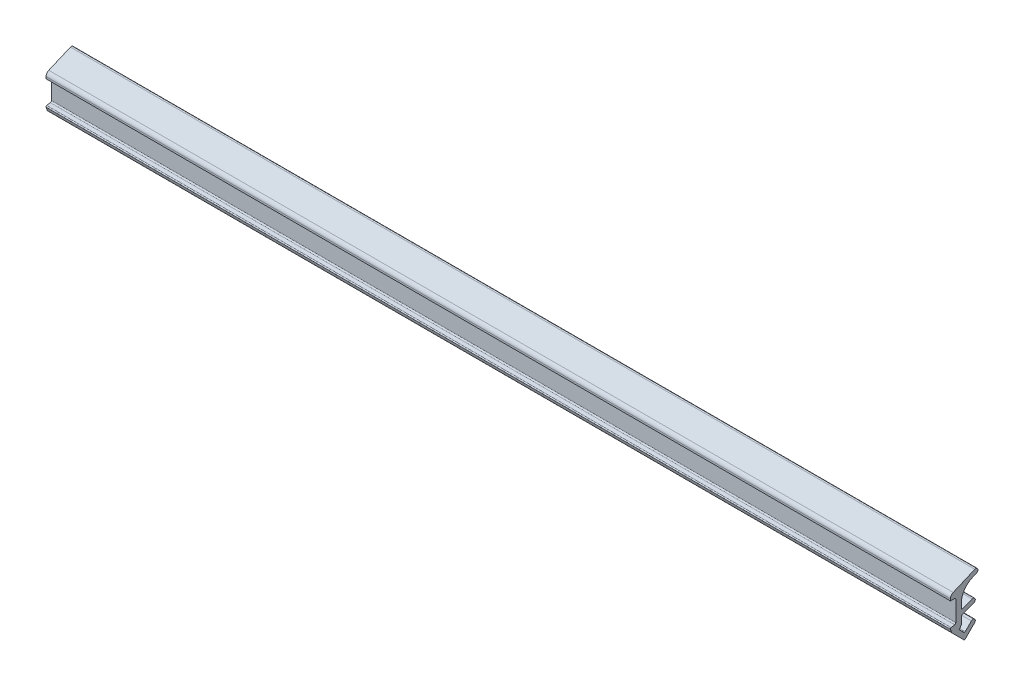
ISO-10303-21;
HEADER;
FILE_DESCRIPTION(('STEP AP214'),'2;1');
FILE_NAME('part.step','',(''),(''),'','','');
FILE_SCHEMA(('AUTOMOTIVE_DESIGN { 1 0 10303 214 1 1 1 1 }'));
ENDSEC;
DATA;
#1=APPLICATION_CONTEXT('core data for automotive mechanical design processes');
#2=APPLICATION_PROTOCOL_DEFINITION('international standard','automotive_design',2000,#1);
#3=PRODUCT_CONTEXT('',#1,'mechanical');
#4=PRODUCT('Part','Part','',(#3));
#5=PRODUCT_RELATED_PRODUCT_CATEGORY('part','',(#4));
#6=PRODUCT_DEFINITION_FORMATION('','',#4);
#7=PRODUCT_DEFINITION_CONTEXT('part definition',#1,'design');
#8=PRODUCT_DEFINITION('design','',#6,#7);
#9=PRODUCT_DEFINITION_SHAPE('','',#8);
#10=(LENGTH_UNIT() NAMED_UNIT(*) SI_UNIT(.MILLI.,.METRE.));
#11=(NAMED_UNIT(*) PLANE_ANGLE_UNIT() SI_UNIT($,.RADIAN.));
#12=(NAMED_UNIT(*) SI_UNIT($,.STERADIAN.) SOLID_ANGLE_UNIT());
#13=UNCERTAINTY_MEASURE_WITH_UNIT(LENGTH_MEASURE(1.E-05),#10,'distance_accuracy_value','');
#14=(GEOMETRIC_REPRESENTATION_CONTEXT(3) GLOBAL_UNCERTAINTY_ASSIGNED_CONTEXT((#13)) GLOBAL_UNIT_ASSIGNED_CONTEXT((#10,
#11,#12)) REPRESENTATION_CONTEXT('',''));
#15=CARTESIAN_POINT('',(0.,0.,0.));
#16=DIRECTION('',(0.,0.,1.));
#17=DIRECTION('',(1.,0.,0.));
#18=AXIS2_PLACEMENT_3D('',#15,#16,#17);
#19=CARTESIAN_POINT('',(200.,1.97501045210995,-4.37734930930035));
#20=DIRECTION('',(-1.,0.,0.));
#21=DIRECTION('',(0.,0.,1.));
#22=AXIS2_PLACEMENT_3D('',#19,#20,#21);
#23=CYLINDRICAL_SURFACE('',#22,4.00000000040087);
#24=CARTESIAN_POINT('',(0.,1.97501045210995,-4.37734930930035));
#25=DIRECTION('',(-1.,0.,0.));
#26=DIRECTION('',(0.,0.,-1.));
#27=AXIS2_PLACEMENT_3D('',#24,#25,#26);
#28=CIRCLE('',#27,4.00000000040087);
#29=CARTESIAN_POINT('',(0.,1.97501045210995,-0.377349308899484));
#30=VERTEX_POINT('',#29);
#31=CARTESIAN_POINT('',(0.,5.65620287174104,-2.81247794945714));
#32=VERTEX_POINT('',#31);
#33=EDGE_CURVE('E375',#30,#32,#28,.T.);
#34=ORIENTED_EDGE('',*,*,#33,.T.);
#35=DIRECTION('',(-1.,0.,0.));
#36=VECTOR('',#35,1.);
#37=CARTESIAN_POINT('',(200.,5.65620287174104,-2.81247794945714));
#38=LINE('',#37,#36);
#39=CARTESIAN_POINT('',(200.,5.65620287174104,-2.81247794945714));
#40=VERTEX_POINT('',#39);
#41=EDGE_CURVE('E13',#40,#32,#38,.T.);
#42=ORIENTED_EDGE('',*,*,#41,.F.);
#43=CARTESIAN_POINT('',(200.,1.97501045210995,-4.37734930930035));
#44=DIRECTION('',(-1.,0.,0.));
#45=DIRECTION('',(0.,0.,-1.));
#46=AXIS2_PLACEMENT_3D('',#43,#44,#45);
#47=CIRCLE('',#46,4.00000000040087);
#48=CARTESIAN_POINT('',(200.,1.97501045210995,-0.377349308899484));
#49=VERTEX_POINT('',#48);
#50=EDGE_CURVE('E435',#49,#40,#47,.T.);
#51=ORIENTED_EDGE('',*,*,#50,.F.);
#52=DIRECTION('',(-1.,0.,0.));
#53=VECTOR('',#52,1.);
#54=CARTESIAN_POINT('',(200.,1.97501045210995,-0.377349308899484));
#55=LINE('',#54,#53);
#56=EDGE_CURVE('E371',#49,#30,#55,.T.);
#57=ORIENTED_EDGE('',*,*,#56,.T.);
#58=EDGE_LOOP('',(#34,#42,#51,#57));
#59=FACE_BOUND('',#58,.T.);
#60=ADVANCED_FACE('F141',(#59),#23,.F.);
#61=CARTESIAN_POINT('',(200.,5.65620287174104,-2.81247794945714));
#62=DIRECTION('',(0.,0.920298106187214,0.391217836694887));
#63=DIRECTION('',(0.,-0.391217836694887,0.920298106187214));
#64=AXIS2_PLACEMENT_3D('',#61,#62,#63);
#65=PLANE('',#64);
#66=DIRECTION('',(0.,0.391217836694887,-0.920298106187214));
#67=VECTOR('',#66,1.);
#68=CARTESIAN_POINT('',(0.,5.65620287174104,-2.81247794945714));
#69=LINE('',#68,#67);
#70=CARTESIAN_POINT('',(0.,6.06450211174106,-3.77295822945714));
#71=VERTEX_POINT('',#70);
#72=EDGE_CURVE('E378',#32,#71,#69,.T.);
#73=ORIENTED_EDGE('',*,*,#72,.T.);
#74=DIRECTION('',(-1.,0.,0.));
#75=VECTOR('',#74,1.);
#76=CARTESIAN_POINT('',(200.,6.06450211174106,-3.77295822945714));
#77=LINE('',#76,#75);
#78=CARTESIAN_POINT('',(200.,6.06450211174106,-3.77295822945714));
#79=VERTEX_POINT('',#78);
#80=EDGE_CURVE('E149',#79,#71,#77,.T.);
#81=ORIENTED_EDGE('',*,*,#80,.F.);
#82=DIRECTION('',(0.,0.391217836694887,-0.920298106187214));
#83=VECTOR('',#82,1.);
#84=CARTESIAN_POINT('',(200.,5.65620287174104,-2.81247794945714));
#85=LINE('',#84,#83);
#86=EDGE_CURVE('E269',#40,#79,#85,.T.);
#87=ORIENTED_EDGE('',*,*,#86,.F.);
#88=ORIENTED_EDGE('',*,*,#41,.T.);
#89=EDGE_LOOP('',(#73,#81,#87,#88));
#90=FACE_BOUND('',#89,.T.);
#91=ADVANCED_FACE('F608',(#90),#65,.F.);
#92=CARTESIAN_POINT('',(200.,6.52465116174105,-3.57734930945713));
#93=DIRECTION('',(-1.,0.,0.));
#94=DIRECTION('',(0.,0.,1.));
#95=AXIS2_PLACEMENT_3D('',#92,#93,#94);
#96=CYLINDRICAL_SURFACE('',#95,0.499999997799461);
#97=CARTESIAN_POINT('',(0.,6.52465116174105,-3.57734930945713));
#98=DIRECTION('',(1.,0.,0.));
#99=DIRECTION('',(0.,0.,-1.));
#100=AXIS2_PLACEMENT_3D('',#97,#98,#99);
#101=CIRCLE('',#100,0.499999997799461);
#102=CARTESIAN_POINT('',(0.,6.98480021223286,-3.38174039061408));
#103=VERTEX_POINT('',#102);
#104=EDGE_CURVE('E380',#71,#103,#101,.T.);
#105=ORIENTED_EDGE('',*,*,#104,.T.);
#106=DIRECTION('',(-1.,0.,0.));
#107=VECTOR('',#106,1.);
#108=CARTESIAN_POINT('',(200.,6.98480021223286,-3.38174039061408));
#109=LINE('',#108,#107);
#110=CARTESIAN_POINT('',(200.,6.98480021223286,-3.38174039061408));
#111=VERTEX_POINT('',#110);
#112=EDGE_CURVE('E511',#111,#103,#109,.T.);
#113=ORIENTED_EDGE('',*,*,#112,.F.);
#114=CARTESIAN_POINT('',(200.,6.52465116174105,-3.57734930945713));
#115=DIRECTION('',(1.,0.,0.));
#116=DIRECTION('',(0.,0.,-1.));
#117=AXIS2_PLACEMENT_3D('',#114,#115,#116);
#118=CIRCLE('',#117,0.499999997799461);
#119=EDGE_CURVE('E519',#79,#111,#118,.T.);
#120=ORIENTED_EDGE('',*,*,#119,.F.);
#121=ORIENTED_EDGE('',*,*,#80,.T.);
#122=EDGE_LOOP('',(#105,#113,#120,#121));
#123=FACE_BOUND('',#122,.T.);
#124=ADVANCED_FACE('F517',(#123),#96,.T.);
#125=CARTESIAN_POINT('',(200.,6.98480021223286,-3.38174039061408));
#126=DIRECTION('',(0.,-0.920298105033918,-0.391217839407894));
#127=DIRECTION('',(0.,0.391217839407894,-0.920298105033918));
#128=AXIS2_PLACEMENT_3D('',#125,#126,#127);
#129=PLANE('',#128);
#130=DIRECTION('',(0.,-0.391217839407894,0.920298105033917));
#131=VECTOR('',#130,1.);
#132=CARTESIAN_POINT('',(0.,6.98480021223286,-3.38174039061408));
#133=LINE('',#132,#131);
#134=CARTESIAN_POINT('',(0.,4.946191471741,1.41386853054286));
#135=VERTEX_POINT('',#134);
#136=EDGE_CURVE('E382',#103,#135,#133,.T.);
#137=ORIENTED_EDGE('',*,*,#136,.T.);
#138=DIRECTION('',(-1.,0.,0.));
#139=VECTOR('',#138,1.);
#140=CARTESIAN_POINT('',(200.,4.946191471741,1.41386853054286));
#141=LINE('',#140,#139);
#142=CARTESIAN_POINT('',(200.,4.946191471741,1.41386853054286));
#143=VERTEX_POINT('',#142);
#144=EDGE_CURVE('E508',#143,#135,#141,.T.);
#145=ORIENTED_EDGE('',*,*,#144,.F.);
#146=DIRECTION('',(0.,-0.391217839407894,0.920298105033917));
#147=VECTOR('',#146,1.);
#148=CARTESIAN_POINT('',(200.,6.98480021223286,-3.38174039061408));
#149=LINE('',#148,#147);
#150=EDGE_CURVE('E537',#111,#143,#149,.T.);
#151=ORIENTED_EDGE('',*,*,#150,.F.);
#152=ORIENTED_EDGE('',*,*,#112,.T.);
#153=EDGE_LOOP('',(#137,#145,#151,#152));
#154=FACE_BOUND('',#153,.T.);
#155=ADVANCED_FACE('F528',(#154),#129,.F.);
#156=CARTESIAN_POINT('',(200.,4.02589336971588,1.02265068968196));
#157=DIRECTION('',(-1.,0.,0.));
#158=DIRECTION('',(0.,0.,1.));
#159=AXIS2_PLACEMENT_3D('',#156,#157,#158);
#160=CYLINDRICAL_SURFACE('',#159,0.999999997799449);
#161=CARTESIAN_POINT('',(0.,4.02589336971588,1.02265068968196));
#162=DIRECTION('',(1.,0.,0.));
#163=DIRECTION('',(0.,0.,-1.));
#164=AXIS2_PLACEMENT_3D('',#161,#162,#163);
#165=CIRCLE('',#164,0.999999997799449);
#166=CARTESIAN_POINT('',(0.,4.02589336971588,2.02265068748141));
#167=VERTEX_POINT('',#166);
#168=EDGE_CURVE('E384',#135,#167,#165,.T.);
#169=ORIENTED_EDGE('',*,*,#168,.T.);
#170=DIRECTION('',(-1.,0.,0.));
#171=VECTOR('',#170,1.);
#172=CARTESIAN_POINT('',(200.,4.02589336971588,2.02265068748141));
#173=LINE('',#172,#171);
#174=CARTESIAN_POINT('',(200.,4.02589336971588,2.02265068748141));
#175=VERTEX_POINT('',#174);
#176=EDGE_CURVE('E505',#175,#167,#173,.T.);
#177=ORIENTED_EDGE('',*,*,#176,.F.);
#178=CARTESIAN_POINT('',(200.,4.02589336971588,1.02265068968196));
#179=DIRECTION('',(1.,0.,0.));
#180=DIRECTION('',(0.,0.,-1.));
#181=AXIS2_PLACEMENT_3D('',#178,#179,#180);
#182=CIRCLE('',#181,0.999999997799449);
#183=EDGE_CURVE('E534',#143,#175,#182,.T.);
#184=ORIENTED_EDGE('',*,*,#183,.F.);
#185=ORIENTED_EDGE('',*,*,#144,.T.);
#186=EDGE_LOOP('',(#169,#177,#184,#185));
#187=FACE_BOUND('',#186,.T.);
#188=ADVANCED_FACE('F532',(#187),#160,.T.);
#189=CARTESIAN_POINT('',(200.,4.02589336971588,2.02265068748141));
#190=DIRECTION('',(0.,0.,-1.));
#191=DIRECTION('',(0.,1.,0.));
#192=AXIS2_PLACEMENT_3D('',#189,#190,#191);
#193=PLANE('',#192);
#194=DIRECTION('',(0.,-1.,0.));
#195=VECTOR('',#194,1.);
#196=CARTESIAN_POINT('',(0.,4.02589336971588,2.02265068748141));
#197=LINE('',#196,#195);
#198=CARTESIAN_POINT('',(0.,3.62465118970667,2.02265068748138));
#199=VERTEX_POINT('',#198);
#200=EDGE_CURVE('E386',#167,#199,#197,.T.);
#201=ORIENTED_EDGE('',*,*,#200,.T.);
#202=DIRECTION('',(-1.,0.,0.));
#203=VECTOR('',#202,1.);
#204=CARTESIAN_POINT('',(200.,3.62465118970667,2.02265068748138));
#205=LINE('',#204,#203);
#206=CARTESIAN_POINT('',(200.,3.62465118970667,2.02265068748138));
#207=VERTEX_POINT('',#206);
#208=EDGE_CURVE('E502',#207,#199,#205,.T.);
#209=ORIENTED_EDGE('',*,*,#208,.F.);
#210=DIRECTION('',(0.,-1.,0.));
#211=VECTOR('',#210,1.);
#212=CARTESIAN_POINT('',(200.,4.02589336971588,2.02265068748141));
#213=LINE('',#212,#211);
#214=EDGE_CURVE('E536',#175,#207,#213,.T.);
#215=ORIENTED_EDGE('',*,*,#214,.F.);
#216=ORIENTED_EDGE('',*,*,#176,.T.);
#217=EDGE_LOOP('',(#201,#209,#215,#216));
#218=FACE_BOUND('',#217,.T.);
#219=ADVANCED_FACE('F621',(#218),#193,.F.);
#220=CARTESIAN_POINT('',(200.,3.62465118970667,2.02265068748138));
#221=DIRECTION('',(0.,1.,0.));
#222=DIRECTION('',(0.,0.,1.));
#223=AXIS2_PLACEMENT_3D('',#220,#221,#222);
#224=PLANE('',#223);
#225=DIRECTION('',(0.,0.,-1.));
#226=VECTOR('',#225,1.);
#227=CARTESIAN_POINT('',(0.,3.62465118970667,2.02265068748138));
#228=LINE('',#227,#226);
#229=CARTESIAN_POINT('',(0.,3.62465118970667,1.12265069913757));
#230=VERTEX_POINT('',#229);
#231=EDGE_CURVE('E388',#199,#230,#228,.T.);
#232=ORIENTED_EDGE('',*,*,#231,.T.);
#233=DIRECTION('',(-1.,0.,0.));
#234=VECTOR('',#233,1.);
#235=CARTESIAN_POINT('',(200.,3.62465118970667,1.12265069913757));
#236=LINE('',#235,#234);
#237=CARTESIAN_POINT('',(200.,3.62465118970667,1.12265069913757));
#238=VERTEX_POINT('',#237);
#239=EDGE_CURVE('E499',#238,#230,#236,.T.);
#240=ORIENTED_EDGE('',*,*,#239,.F.);
#241=DIRECTION('',(0.,0.,-1.));
#242=VECTOR('',#241,1.);
#243=CARTESIAN_POINT('',(200.,3.62465118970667,2.02265068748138));
#244=LINE('',#243,#242);
#245=EDGE_CURVE('E539',#207,#238,#244,.T.);
#246=ORIENTED_EDGE('',*,*,#245,.F.);
#247=ORIENTED_EDGE('',*,*,#208,.T.);
#248=EDGE_LOOP('',(#232,#240,#246,#247));
#249=FACE_BOUND('',#248,.T.);
#250=ADVANCED_FACE('F624',(#249),#224,.F.);
#251=CARTESIAN_POINT('',(200.,3.32465118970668,1.12265069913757));
#252=DIRECTION('',(-1.,0.,0.));
#253=DIRECTION('',(0.,0.,1.));
#254=AXIS2_PLACEMENT_3D('',#251,#252,#253);
#255=CYLINDRICAL_SURFACE('',#254,0.299999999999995);
#256=CARTESIAN_POINT('',(0.,3.32465118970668,1.12265069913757));
#257=DIRECTION('',(-1.,0.,0.));
#258=DIRECTION('',(0.,0.,-1.));
#259=AXIS2_PLACEMENT_3D('',#256,#257,#258);
#260=CIRCLE('',#259,0.299999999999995);
#261=CARTESIAN_POINT('',(0.,3.32465118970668,0.822650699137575));
#262=VERTEX_POINT('',#261);
#263=EDGE_CURVE('E390',#230,#262,#260,.T.);
#264=ORIENTED_EDGE('',*,*,#263,.T.);
#265=DIRECTION('',(-1.,0.,0.));
#266=VECTOR('',#265,1.);
#267=CARTESIAN_POINT('',(200.,3.32465118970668,0.822650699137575));
#268=LINE('',#267,#266);
#269=CARTESIAN_POINT('',(200.,3.32465118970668,0.822650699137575));
#270=VERTEX_POINT('',#269);
#271=EDGE_CURVE('E496',#270,#262,#268,.T.);
#272=ORIENTED_EDGE('',*,*,#271,.F.);
#273=CARTESIAN_POINT('',(200.,3.32465118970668,1.12265069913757));
#274=DIRECTION('',(-1.,0.,0.));
#275=DIRECTION('',(0.,0.,-1.));
#276=AXIS2_PLACEMENT_3D('',#273,#274,#275);
#277=CIRCLE('',#276,0.299999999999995);
#278=EDGE_CURVE('E545',#238,#270,#277,.T.);
#279=ORIENTED_EDGE('',*,*,#278,.F.);
#280=ORIENTED_EDGE('',*,*,#239,.T.);
#281=EDGE_LOOP('',(#264,#272,#279,#280));
#282=FACE_BOUND('',#281,.T.);
#283=ADVANCED_FACE('F628',(#282),#255,.F.);
#284=CARTESIAN_POINT('',(200.,3.32465118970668,0.822650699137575));
#285=DIRECTION('',(0.,0.,-1.));
#286=DIRECTION('',(-1.,0.,0.));
#287=AXIS2_PLACEMENT_3D('',#284,#285,#286);
#288=PLANE('',#287);
#289=DIRECTION('',(0.,-1.,0.));
#290=VECTOR('',#289,1.);
#291=CARTESIAN_POINT('',(0.,3.32465118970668,0.822650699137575));
#292=LINE('',#291,#290);
#293=CARTESIAN_POINT('',(0.,-1.12361892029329,0.822650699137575));
#294=VERTEX_POINT('',#293);
#295=EDGE_CURVE('E392',#262,#294,#292,.T.);
#296=ORIENTED_EDGE('',*,*,#295,.T.);
#297=DIRECTION('',(-1.,0.,0.));
#298=VECTOR('',#297,1.);
#299=CARTESIAN_POINT('',(200.,-1.12361892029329,0.822650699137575));
#300=LINE('',#299,#298);
#301=CARTESIAN_POINT('',(200.,-1.12361892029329,0.822650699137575));
#302=VERTEX_POINT('',#301);
#303=EDGE_CURVE('E493',#302,#294,#300,.T.);
#304=ORIENTED_EDGE('',*,*,#303,.F.);
#305=DIRECTION('',(0.,-1.,0.));
#306=VECTOR('',#305,1.);
#307=CARTESIAN_POINT('',(200.,3.32465118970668,0.822650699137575));
#308=LINE('',#307,#306);
#309=EDGE_CURVE('E547',#270,#302,#308,.T.);
#310=ORIENTED_EDGE('',*,*,#309,.F.);
#311=ORIENTED_EDGE('',*,*,#271,.T.);
#312=EDGE_LOOP('',(#296,#304,#310,#311));
#313=FACE_BOUND('',#312,.T.);
#314=ADVANCED_FACE('F632',(#313),#288,.F.);
#315=CARTESIAN_POINT('',(200.,-1.12361892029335,1.1226507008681));
#316=DIRECTION('',(-1.,0.,0.));
#317=DIRECTION('',(0.,0.,1.));
#318=AXIS2_PLACEMENT_3D('',#315,#316,#317);
#319=CYLINDRICAL_SURFACE('',#318,0.30000000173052);
#320=CARTESIAN_POINT('',(0.,-1.12361892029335,1.1226507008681));
#321=DIRECTION('',(-1.,0.,0.));
#322=DIRECTION('',(0.,0.,-1.));
#323=AXIS2_PLACEMENT_3D('',#320,#321,#322);
#324=CIRCLE('',#323,0.30000000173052);
#325=CARTESIAN_POINT('',(0.,-1.41906124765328,1.07055624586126));
#326=VERTEX_POINT('',#325);
#327=EDGE_CURVE('E394',#294,#326,#324,.T.);
#328=ORIENTED_EDGE('',*,*,#327,.T.);
#329=DIRECTION('',(-1.,0.,0.));
#330=VECTOR('',#329,1.);
#331=CARTESIAN_POINT('',(200.,-1.41906124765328,1.07055624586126));
#332=LINE('',#331,#330);
#333=CARTESIAN_POINT('',(200.,-1.41906124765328,1.07055624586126));
#334=VERTEX_POINT('',#333);
#335=EDGE_CURVE('E490',#334,#326,#332,.T.);
#336=ORIENTED_EDGE('',*,*,#335,.F.);
#337=CARTESIAN_POINT('',(200.,-1.12361892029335,1.1226507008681));
#338=DIRECTION('',(-1.,0.,0.));
#339=DIRECTION('',(0.,0.,-1.));
#340=AXIS2_PLACEMENT_3D('',#337,#338,#339);
#341=CIRCLE('',#340,0.30000000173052);
#342=EDGE_CURVE('E549',#302,#334,#341,.T.);
#343=ORIENTED_EDGE('',*,*,#342,.F.);
#344=ORIENTED_EDGE('',*,*,#303,.T.);
#345=EDGE_LOOP('',(#328,#336,#343,#344));
#346=FACE_BOUND('',#345,.T.);
#347=ADVANCED_FACE('F636',(#346),#319,.F.);
#348=CARTESIAN_POINT('',(200.,-1.41906124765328,1.07055624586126));
#349=DIRECTION('',(0.,-0.984807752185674,-0.173648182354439));
#350=DIRECTION('',(0.,0.173648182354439,-0.984807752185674));
#351=AXIS2_PLACEMENT_3D('',#348,#349,#350);
#352=PLANE('',#351);
#353=DIRECTION('',(0.,-0.173648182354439,0.984807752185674));
#354=VECTOR('',#353,1.);
#355=CARTESIAN_POINT('',(0.,-1.41906124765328,1.07055624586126));
#356=LINE('',#355,#354);
#357=CARTESIAN_POINT('',(0.,-1.55779956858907,1.85738034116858));
#358=VERTEX_POINT('',#357);
#359=EDGE_CURVE('E396',#326,#358,#356,.T.);
#360=ORIENTED_EDGE('',*,*,#359,.T.);
#361=DIRECTION('',(-1.,0.,0.));
#362=VECTOR('',#361,1.);
#363=CARTESIAN_POINT('',(200.,-1.55779956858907,1.85738034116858));
#364=LINE('',#363,#362);
#365=CARTESIAN_POINT('',(200.,-1.55779956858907,1.85738034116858));
#366=VERTEX_POINT('',#365);
#367=EDGE_CURVE('E487',#366,#358,#364,.T.);
#368=ORIENTED_EDGE('',*,*,#367,.F.);
#369=DIRECTION('',(0.,-0.173648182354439,0.984807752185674));
#370=VECTOR('',#369,1.);
#371=CARTESIAN_POINT('',(200.,-1.41906124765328,1.07055624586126));
#372=LINE('',#371,#370);
#373=EDGE_CURVE('E551',#334,#366,#372,.T.);
#374=ORIENTED_EDGE('',*,*,#373,.F.);
#375=ORIENTED_EDGE('',*,*,#335,.T.);
#376=EDGE_LOOP('',(#360,#368,#374,#375));
#377=FACE_BOUND('',#376,.T.);
#378=ADVANCED_FACE('F640',(#377),#352,.F.);
#379=CARTESIAN_POINT('',(200.,-1.75476112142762,1.82265070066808));
#380=DIRECTION('',(-1.,0.,0.));
#381=DIRECTION('',(0.,0.,1.));
#382=AXIS2_PLACEMENT_3D('',#379,#380,#381);
#383=CYLINDRICAL_SURFACE('',#382,0.200000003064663);
#384=CARTESIAN_POINT('',(0.,-1.75476112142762,1.82265070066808));
#385=DIRECTION('',(1.,0.,0.));
#386=DIRECTION('',(0.,0.,-1.));
#387=AXIS2_PLACEMENT_3D('',#384,#385,#386);
#388=CIRCLE('',#387,0.200000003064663);
#389=CARTESIAN_POINT('',(0.,-1.82316515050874,2.0105892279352));
#390=VERTEX_POINT('',#389);
#391=EDGE_CURVE('E398',#358,#390,#388,.T.);
#392=ORIENTED_EDGE('',*,*,#391,.T.);
#393=DIRECTION('',(-1.,0.,0.));
#394=VECTOR('',#393,1.);
#395=CARTESIAN_POINT('',(200.,-1.82316515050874,2.0105892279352));
#396=LINE('',#395,#394);
#397=CARTESIAN_POINT('',(200.,-1.82316515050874,2.0105892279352));
#398=VERTEX_POINT('',#397);
#399=EDGE_CURVE('E484',#398,#390,#396,.T.);
#400=ORIENTED_EDGE('',*,*,#399,.F.);
#401=CARTESIAN_POINT('',(200.,-1.75476112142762,1.82265070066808));
#402=DIRECTION('',(1.,0.,0.));
#403=DIRECTION('',(0.,0.,-1.));
#404=AXIS2_PLACEMENT_3D('',#401,#402,#403);
#405=CIRCLE('',#404,0.200000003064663);
#406=EDGE_CURVE('E553',#366,#398,#405,.T.);
#407=ORIENTED_EDGE('',*,*,#406,.F.);
#408=ORIENTED_EDGE('',*,*,#367,.T.);
#409=EDGE_LOOP('',(#392,#400,#407,#408));
#410=FACE_BOUND('',#409,.T.);
#411=ADVANCED_FACE('F644',(#410),#383,.T.);
#412=CARTESIAN_POINT('',(200.,-1.82316515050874,2.0105892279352));
#413=DIRECTION('',(0.,0.34202014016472,-0.939692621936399));
#414=DIRECTION('',(0.,0.9396926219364,0.34202014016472));
#415=AXIS2_PLACEMENT_3D('',#412,#413,#414);
#416=PLANE('',#415);
#417=DIRECTION('',(0.,-0.939692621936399,-0.34202014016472));
#418=VECTOR('',#417,1.);
#419=CARTESIAN_POINT('',(0.,-1.82316515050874,2.0105892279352));
#420=LINE('',#419,#418);
#421=CARTESIAN_POINT('',(0.,-2.60351169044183,1.72656631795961));
#422=VERTEX_POINT('',#421);
#423=EDGE_CURVE('E400',#390,#422,#420,.T.);
#424=ORIENTED_EDGE('',*,*,#423,.T.);
#425=DIRECTION('',(-1.,0.,0.));
#426=VECTOR('',#425,1.);
#427=CARTESIAN_POINT('',(200.,-2.60351169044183,1.72656631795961));
#428=LINE('',#427,#426);
#429=CARTESIAN_POINT('',(200.,-2.60351169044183,1.72656631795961));
#430=VERTEX_POINT('',#429);
#431=EDGE_CURVE('E481',#430,#422,#428,.T.);
#432=ORIENTED_EDGE('',*,*,#431,.F.);
#433=DIRECTION('',(0.,-0.939692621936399,-0.34202014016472));
#434=VECTOR('',#433,1.);
#435=CARTESIAN_POINT('',(200.,-1.82316515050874,2.0105892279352));
#436=LINE('',#435,#434);
#437=EDGE_CURVE('E555',#398,#430,#436,.T.);
#438=ORIENTED_EDGE('',*,*,#437,.F.);
#439=ORIENTED_EDGE('',*,*,#399,.T.);
#440=EDGE_LOOP('',(#424,#432,#438,#439));
#441=FACE_BOUND('',#440,.T.);
#442=ADVANCED_FACE('F648',(#441),#416,.F.);
#443=CARTESIAN_POINT('',(200.,-2.53510766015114,1.53862779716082));
#444=DIRECTION('',(-1.,0.,0.));
#445=DIRECTION('',(0.,0.,1.));
#446=AXIS2_PLACEMENT_3D('',#443,#444,#445);
#447=CYLINDRICAL_SURFACE('',#446,0.199999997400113);
#448=CARTESIAN_POINT('',(0.,-2.53510766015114,1.53862779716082));
#449=DIRECTION('',(1.,0.,0.));
#450=DIRECTION('',(0.,0.,-1.));
#451=AXIS2_PLACEMENT_3D('',#448,#449,#450);
#452=CIRCLE('',#451,0.199999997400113);
#453=CARTESIAN_POINT('',(0.,-2.67652901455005,1.68004915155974));
#454=VERTEX_POINT('',#453);
#455=EDGE_CURVE('E402',#422,#454,#452,.T.);
#456=ORIENTED_EDGE('',*,*,#455,.T.);
#457=DIRECTION('',(-1.,0.,0.));
#458=VECTOR('',#457,1.);
#459=CARTESIAN_POINT('',(200.,-2.67652901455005,1.68004915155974));
#460=LINE('',#459,#458);
#461=CARTESIAN_POINT('',(200.,-2.67652901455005,1.68004915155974));
#462=VERTEX_POINT('',#461);
#463=EDGE_CURVE('E478',#462,#454,#460,.T.);
#464=ORIENTED_EDGE('',*,*,#463,.F.);
#465=CARTESIAN_POINT('',(200.,-2.53510766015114,1.53862779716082));
#466=DIRECTION('',(1.,0.,0.));
#467=DIRECTION('',(0.,0.,-1.));
#468=AXIS2_PLACEMENT_3D('',#465,#466,#467);
#469=CIRCLE('',#468,0.199999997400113);
#470=EDGE_CURVE('E557',#430,#462,#469,.T.);
#471=ORIENTED_EDGE('',*,*,#470,.F.);
#472=ORIENTED_EDGE('',*,*,#431,.T.);
#473=EDGE_LOOP('',(#456,#464,#471,#472));
#474=FACE_BOUND('',#473,.T.);
#475=ADVANCED_FACE('F652',(#474),#447,.T.);
#476=CARTESIAN_POINT('',(200.,-2.67652901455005,1.68004915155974));
#477=DIRECTION('',(0.,0.707106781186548,-0.707106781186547));
#478=DIRECTION('',(0.,0.707106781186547,0.707106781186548));
#479=AXIS2_PLACEMENT_3D('',#476,#477,#478);
#480=PLANE('',#479);
#481=DIRECTION('',(0.,-0.707106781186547,-0.707106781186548));
#482=VECTOR('',#481,1.);
#483=CARTESIAN_POINT('',(0.,-2.67652901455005,1.68004915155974));
#484=LINE('',#483,#482);
#485=CARTESIAN_POINT('',(0.,-5.31677017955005,-0.960192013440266));
#486=VERTEX_POINT('',#485);
#487=EDGE_CURVE('E404',#454,#486,#484,.T.);
#488=ORIENTED_EDGE('',*,*,#487,.T.);
#489=DIRECTION('',(-1.,0.,0.));
#490=VECTOR('',#489,1.);
#491=CARTESIAN_POINT('',(200.,-5.31677017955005,-0.960192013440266));
#492=LINE('',#491,#490);
#493=CARTESIAN_POINT('',(200.,-5.31677017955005,-0.960192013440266));
#494=VERTEX_POINT('',#493);
#495=EDGE_CURVE('E475',#494,#486,#492,.T.);
#496=ORIENTED_EDGE('',*,*,#495,.F.);
#497=DIRECTION('',(0.,-0.707106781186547,-0.707106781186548));
#498=VECTOR('',#497,1.);
#499=CARTESIAN_POINT('',(200.,-2.67652901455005,1.68004915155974));
#500=LINE('',#499,#498);
#501=EDGE_CURVE('E559',#462,#494,#500,.T.);
#502=ORIENTED_EDGE('',*,*,#501,.F.);
#503=ORIENTED_EDGE('',*,*,#463,.T.);
#504=EDGE_LOOP('',(#488,#496,#502,#503));
#505=FACE_BOUND('',#504,.T.);
#506=ADVANCED_FACE('F656',(#505),#480,.F.);
#507=CARTESIAN_POINT('',(200.,-5.17534882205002,-1.10161337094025));
#508=DIRECTION('',(-1.,0.,0.));
#509=DIRECTION('',(0.,0.,1.));
#510=AXIS2_PLACEMENT_3D('',#507,#508,#509);
#511=CYLINDRICAL_SURFACE('',#510,0.200000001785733);
#512=CARTESIAN_POINT('',(0.,-5.17534882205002,-1.10161337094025));
#513=DIRECTION('',(1.,0.,0.));
#514=DIRECTION('',(0.,0.,-1.));
#515=AXIS2_PLACEMENT_3D('',#512,#513,#514);
#516=CIRCLE('',#515,0.200000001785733);
#517=CARTESIAN_POINT('',(0.,-5.31677017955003,-1.24303472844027));
#518=VERTEX_POINT('',#517);
#519=EDGE_CURVE('E406',#486,#518,#516,.T.);
#520=ORIENTED_EDGE('',*,*,#519,.T.);
#521=DIRECTION('',(-1.,0.,0.));
#522=VECTOR('',#521,1.);
#523=CARTESIAN_POINT('',(200.,-5.31677017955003,-1.24303472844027));
#524=LINE('',#523,#522);
#525=CARTESIAN_POINT('',(200.,-5.31677017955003,-1.24303472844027));
#526=VERTEX_POINT('',#525);
#527=EDGE_CURVE('E472',#526,#518,#524,.T.);
#528=ORIENTED_EDGE('',*,*,#527,.F.);
#529=CARTESIAN_POINT('',(200.,-5.17534882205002,-1.10161337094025));
#530=DIRECTION('',(1.,0.,0.));
#531=DIRECTION('',(0.,0.,-1.));
#532=AXIS2_PLACEMENT_3D('',#529,#530,#531);
#533=CIRCLE('',#532,0.200000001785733);
#534=EDGE_CURVE('E561',#494,#526,#533,.T.);
#535=ORIENTED_EDGE('',*,*,#534,.F.);
#536=ORIENTED_EDGE('',*,*,#495,.T.);
#537=EDGE_LOOP('',(#520,#528,#535,#536));
#538=FACE_BOUND('',#537,.T.);
#539=ADVANCED_FACE('F660',(#538),#511,.T.);
#540=CARTESIAN_POINT('',(200.,-5.31677017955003,-1.24303472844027));
#541=DIRECTION('',(0.,0.707106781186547,0.707106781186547));
#542=DIRECTION('',(0.,-0.707106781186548,0.707106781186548));
#543=AXIS2_PLACEMENT_3D('',#540,#541,#542);
#544=PLANE('',#543);
#545=DIRECTION('',(0.,0.707106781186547,-0.707106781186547));
#546=VECTOR('',#545,1.);
#547=CARTESIAN_POINT('',(0.,-5.31677017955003,-1.24303472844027));
#548=LINE('',#547,#546);
#549=CARTESIAN_POINT('',(0.,-3.22890221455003,-3.33090269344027));
#550=VERTEX_POINT('',#549);
#551=EDGE_CURVE('E408',#518,#550,#548,.T.);
#552=ORIENTED_EDGE('',*,*,#551,.T.);
#553=DIRECTION('',(-1.,0.,0.));
#554=VECTOR('',#553,1.);
#555=CARTESIAN_POINT('',(200.,-3.22890221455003,-3.33090269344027));
#556=LINE('',#555,#554);
#557=CARTESIAN_POINT('',(200.,-3.22890221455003,-3.33090269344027));
#558=VERTEX_POINT('',#557);
#559=EDGE_CURVE('E469',#558,#550,#556,.T.);
#560=ORIENTED_EDGE('',*,*,#559,.F.);
#561=DIRECTION('',(0.,0.707106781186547,-0.707106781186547));
#562=VECTOR('',#561,1.);
#563=CARTESIAN_POINT('',(200.,-5.31677017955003,-1.24303472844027));
#564=LINE('',#563,#562);
#565=EDGE_CURVE('E563',#526,#558,#564,.T.);
#566=ORIENTED_EDGE('',*,*,#565,.F.);
#567=ORIENTED_EDGE('',*,*,#527,.T.);
#568=EDGE_LOOP('',(#552,#560,#566,#567));
#569=FACE_BOUND('',#568,.T.);
#570=ADVANCED_FACE('F664',(#569),#544,.F.);
#571=CARTESIAN_POINT('',(200.,-2.87534882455,-2.97734930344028));
#572=DIRECTION('',(-1.,0.,0.));
#573=DIRECTION('',(0.,0.,1.));
#574=AXIS2_PLACEMENT_3D('',#571,#572,#573);
#575=CYLINDRICAL_SURFACE('',#574,0.499999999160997);
#576=CARTESIAN_POINT('',(0.,-2.87534882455,-2.97734930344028));
#577=DIRECTION('',(1.,0.,0.));
#578=DIRECTION('',(0.,0.,-1.));
#579=AXIS2_PLACEMENT_3D('',#576,#577,#578);
#580=CIRCLE('',#579,0.499999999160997);
#581=CARTESIAN_POINT('',(0.,-2.52179543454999,-2.62379591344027));
#582=VERTEX_POINT('',#581);
#583=EDGE_CURVE('E410',#550,#582,#580,.T.);
#584=ORIENTED_EDGE('',*,*,#583,.T.);
#585=DIRECTION('',(-1.,0.,0.));
#586=VECTOR('',#585,1.);
#587=CARTESIAN_POINT('',(200.,-2.52179543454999,-2.62379591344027));
#588=LINE('',#587,#586);
#589=CARTESIAN_POINT('',(200.,-2.52179543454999,-2.62379591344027));
#590=VERTEX_POINT('',#589);
#591=EDGE_CURVE('E466',#590,#582,#588,.T.);
#592=ORIENTED_EDGE('',*,*,#591,.F.);
#593=CARTESIAN_POINT('',(200.,-2.87534882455,-2.97734930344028));
#594=DIRECTION('',(1.,0.,0.));
#595=DIRECTION('',(0.,0.,-1.));
#596=AXIS2_PLACEMENT_3D('',#593,#594,#595);
#597=CIRCLE('',#596,0.499999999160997);
#598=EDGE_CURVE('E565',#558,#590,#597,.T.);
#599=ORIENTED_EDGE('',*,*,#598,.F.);
#600=ORIENTED_EDGE('',*,*,#559,.T.);
#601=EDGE_LOOP('',(#584,#592,#599,#600));
#602=FACE_BOUND('',#601,.T.);
#603=ADVANCED_FACE('F668',(#602),#575,.T.);
#604=CARTESIAN_POINT('',(200.,-2.52179543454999,-2.62379591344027));
#605=DIRECTION('',(0.,-0.707106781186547,-0.707106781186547));
#606=DIRECTION('',(0.,0.707106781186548,-0.707106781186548));
#607=AXIS2_PLACEMENT_3D('',#604,#605,#606);
#608=PLANE('',#607);
#609=DIRECTION('',(0.,-0.707106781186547,0.707106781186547));
#610=VECTOR('',#609,1.);
#611=CARTESIAN_POINT('',(0.,-2.52179543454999,-2.62379591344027));
#612=LINE('',#611,#610);
#613=CARTESIAN_POINT('',(0.,-3.90255661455,-1.24303473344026));
#614=VERTEX_POINT('',#613);
#615=EDGE_CURVE('E412',#582,#614,#612,.T.);
#616=ORIENTED_EDGE('',*,*,#615,.T.);
#617=DIRECTION('',(-1.,0.,0.));
#618=VECTOR('',#617,1.);
#619=CARTESIAN_POINT('',(200.,-3.90255661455,-1.24303473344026));
#620=LINE('',#619,#618);
#621=CARTESIAN_POINT('',(200.,-3.90255661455,-1.24303473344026));
#622=VERTEX_POINT('',#621);
#623=EDGE_CURVE('E463',#622,#614,#620,.T.);
#624=ORIENTED_EDGE('',*,*,#623,.F.);
#625=DIRECTION('',(0.,-0.707106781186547,0.707106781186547));
#626=VECTOR('',#625,1.);
#627=CARTESIAN_POINT('',(200.,-2.52179543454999,-2.62379591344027));
#628=LINE('',#627,#626);
#629=EDGE_CURVE('E567',#590,#622,#628,.T.);
#630=ORIENTED_EDGE('',*,*,#629,.F.);
#631=ORIENTED_EDGE('',*,*,#591,.T.);
#632=EDGE_LOOP('',(#616,#624,#630,#631));
#633=FACE_BOUND('',#632,.T.);
#634=ADVANCED_FACE('F672',(#633),#608,.F.);
#635=CARTESIAN_POINT('',(200.,-3.76113525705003,-1.10161337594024));
#636=DIRECTION('',(-1.,0.,0.));
#637=DIRECTION('',(0.,0.,1.));
#638=AXIS2_PLACEMENT_3D('',#635,#636,#637);
#639=CYLINDRICAL_SURFACE('',#638,0.200000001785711);
#640=CARTESIAN_POINT('',(0.,-3.76113525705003,-1.10161337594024));
#641=DIRECTION('',(-1.,0.,0.));
#642=DIRECTION('',(0.,0.,-1.));
#643=AXIS2_PLACEMENT_3D('',#640,#641,#642);
#644=CIRCLE('',#643,0.200000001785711);
#645=CARTESIAN_POINT('',(0.,-3.90255661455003,-0.960192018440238));
#646=VERTEX_POINT('',#645);
#647=EDGE_CURVE('E414',#614,#646,#644,.T.);
#648=ORIENTED_EDGE('',*,*,#647,.T.);
#649=DIRECTION('',(-1.,0.,0.));
#650=VECTOR('',#649,1.);
#651=CARTESIAN_POINT('',(200.,-3.90255661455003,-0.960192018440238));
#652=LINE('',#651,#650);
#653=CARTESIAN_POINT('',(200.,-3.90255661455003,-0.960192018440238));
#654=VERTEX_POINT('',#653);
#655=EDGE_CURVE('E460',#654,#646,#652,.T.);
#656=ORIENTED_EDGE('',*,*,#655,.F.);
#657=CARTESIAN_POINT('',(200.,-3.76113525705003,-1.10161337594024));
#658=DIRECTION('',(-1.,0.,0.));
#659=DIRECTION('',(0.,0.,-1.));
#660=AXIS2_PLACEMENT_3D('',#657,#658,#659);
#661=CIRCLE('',#660,0.200000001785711);
#662=EDGE_CURVE('E569',#622,#654,#661,.T.);
#663=ORIENTED_EDGE('',*,*,#662,.F.);
#664=ORIENTED_EDGE('',*,*,#623,.T.);
#665=EDGE_LOOP('',(#648,#656,#663,#664));
#666=FACE_BOUND('',#665,.T.);
#667=ADVANCED_FACE('F676',(#666),#639,.F.);
#668=CARTESIAN_POINT('',(200.,-3.90255661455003,-0.960192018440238));
#669=DIRECTION('',(0.,-0.707106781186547,0.707106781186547));
#670=DIRECTION('',(0.,-0.707106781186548,-0.707106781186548));
#671=AXIS2_PLACEMENT_3D('',#668,#669,#670);
#672=PLANE('',#671);
#673=DIRECTION('',(0.,0.707106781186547,0.707106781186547));
#674=VECTOR('',#673,1.);
#675=CARTESIAN_POINT('',(0.,-3.90255661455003,-0.960192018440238));
#676=LINE('',#675,#674);
#677=CARTESIAN_POINT('',(0.,-2.99298804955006,-0.050623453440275));
#678=VERTEX_POINT('',#677);
#679=EDGE_CURVE('E416',#646,#678,#676,.T.);
#680=ORIENTED_EDGE('',*,*,#679,.T.);
#681=DIRECTION('',(-1.,0.,0.));
#682=VECTOR('',#681,1.);
#683=CARTESIAN_POINT('',(200.,-2.99298804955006,-0.050623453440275));
#684=LINE('',#683,#682);
#685=CARTESIAN_POINT('',(200.,-2.99298804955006,-0.050623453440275));
#686=VERTEX_POINT('',#685);
#687=EDGE_CURVE('E457',#686,#678,#684,.T.);
#688=ORIENTED_EDGE('',*,*,#687,.F.);
#689=DIRECTION('',(0.,0.707106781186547,0.707106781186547));
#690=VECTOR('',#689,1.);
#691=CARTESIAN_POINT('',(200.,-3.90255661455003,-0.960192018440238));
#692=LINE('',#691,#690);
#693=EDGE_CURVE('E571',#654,#686,#692,.T.);
#694=ORIENTED_EDGE('',*,*,#693,.F.);
#695=ORIENTED_EDGE('',*,*,#655,.T.);
#696=EDGE_LOOP('',(#680,#688,#694,#695));
#697=FACE_BOUND('',#696,.T.);
#698=ADVANCED_FACE('F680',(#697),#672,.F.);
#699=CARTESIAN_POINT('',(200.,-2.85156669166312,-0.192044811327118));
#700=DIRECTION('',(-1.,0.,0.));
#701=DIRECTION('',(0.,0.,1.));
#702=AXIS2_PLACEMENT_3D('',#699,#700,#701);
#703=CYLINDRICAL_SURFACE('',#702,0.200000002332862);
#704=CARTESIAN_POINT('',(0.,-2.85156669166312,-0.192044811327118));
#705=DIRECTION('',(-1.,0.,0.));
#706=DIRECTION('',(0.,0.,-1.));
#707=AXIS2_PLACEMENT_3D('',#704,#705,#706);
#708=CIRCLE('',#707,0.200000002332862);
#709=CARTESIAN_POINT('',(0.,-2.75156669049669,-0.0188397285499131));
#710=VERTEX_POINT('',#709);
#711=EDGE_CURVE('E418',#678,#710,#708,.T.);
#712=ORIENTED_EDGE('',*,*,#711,.T.);
#713=DIRECTION('',(-1.,0.,0.));
#714=VECTOR('',#713,1.);
#715=CARTESIAN_POINT('',(200.,-2.75156669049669,-0.0188397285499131));
#716=LINE('',#715,#714);
#717=CARTESIAN_POINT('',(200.,-2.75156669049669,-0.0188397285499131));
#718=VERTEX_POINT('',#717);
#719=EDGE_CURVE('E454',#718,#710,#716,.T.);
#720=ORIENTED_EDGE('',*,*,#719,.F.);
#721=CARTESIAN_POINT('',(200.,-2.85156669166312,-0.192044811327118));
#722=DIRECTION('',(-1.,0.,0.));
#723=DIRECTION('',(0.,0.,-1.));
#724=AXIS2_PLACEMENT_3D('',#721,#722,#723);
#725=CIRCLE('',#724,0.200000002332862);
#726=EDGE_CURVE('E573',#686,#718,#725,.T.);
#727=ORIENTED_EDGE('',*,*,#726,.F.);
#728=ORIENTED_EDGE('',*,*,#687,.T.);
#729=EDGE_LOOP('',(#712,#720,#727,#728));
#730=FACE_BOUND('',#729,.T.);
#731=ADVANCED_FACE('F684',(#730),#703,.F.);
#732=CARTESIAN_POINT('',(200.,-2.75156669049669,-0.0188397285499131));
#733=DIRECTION('',(0.,0.5,0.866025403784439));
#734=DIRECTION('',(0.,-0.866025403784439,0.5));
#735=AXIS2_PLACEMENT_3D('',#732,#733,#734);
#736=PLANE('',#735);
#737=DIRECTION('',(0.,0.866025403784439,-0.5));
#738=VECTOR('',#737,1.);
#739=CARTESIAN_POINT('',(0.,-2.75156669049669,-0.0188397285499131));
#740=LINE('',#739,#738);
#741=CARTESIAN_POINT('',(0.,-2.00381496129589,-0.450554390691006));
#742=VERTEX_POINT('',#741);
#743=EDGE_CURVE('E420',#710,#742,#740,.T.);
#744=ORIENTED_EDGE('',*,*,#743,.T.);
#745=DIRECTION('',(-1.,0.,0.));
#746=VECTOR('',#745,1.);
#747=CARTESIAN_POINT('',(200.,-2.00381496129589,-0.450554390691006));
#748=LINE('',#747,#746);
#749=CARTESIAN_POINT('',(200.,-2.00381496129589,-0.450554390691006));
#750=VERTEX_POINT('',#749);
#751=EDGE_CURVE('E451',#750,#742,#748,.T.);
#752=ORIENTED_EDGE('',*,*,#751,.F.);
#753=DIRECTION('',(0.,0.866025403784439,-0.5));
#754=VECTOR('',#753,1.);
#755=CARTESIAN_POINT('',(200.,-2.75156669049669,-0.0188397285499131));
#756=LINE('',#755,#754);
#757=EDGE_CURVE('E575',#718,#750,#756,.T.);
#758=ORIENTED_EDGE('',*,*,#757,.F.);
#759=ORIENTED_EDGE('',*,*,#719,.T.);
#760=EDGE_LOOP('',(#744,#752,#758,#759));
#761=FACE_BOUND('',#760,.T.);
#762=ADVANCED_FACE('F688',(#761),#736,.F.);
#763=CARTESIAN_POINT('',(200.,-1.90381496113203,-0.277349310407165));
#764=DIRECTION('',(-1.,0.,0.));
#765=DIRECTION('',(0.,0.,1.));
#766=AXIS2_PLACEMENT_3D('',#763,#764,#765);
#767=CYLINDRICAL_SURFACE('',#766,0.199999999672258);
#768=CARTESIAN_POINT('',(0.,-1.90381496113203,-0.277349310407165));
#769=DIRECTION('',(1.,0.,0.));
#770=DIRECTION('',(0.,0.,-1.));
#771=AXIS2_PLACEMENT_3D('',#768,#769,#770);
#772=CIRCLE('',#771,0.199999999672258);
#773=CARTESIAN_POINT('',(0.,-1.90381496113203,-0.477349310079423));
#774=VERTEX_POINT('',#773);
#775=EDGE_CURVE('E422',#742,#774,#772,.T.);
#776=ORIENTED_EDGE('',*,*,#775,.T.);
#777=DIRECTION('',(-1.,0.,0.));
#778=VECTOR('',#777,1.);
#779=CARTESIAN_POINT('',(200.,-1.90381496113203,-0.477349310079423));
#780=LINE('',#779,#778);
#781=CARTESIAN_POINT('',(200.,-1.90381496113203,-0.477349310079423));
#782=VERTEX_POINT('',#781);
#783=EDGE_CURVE('E448',#782,#774,#780,.T.);
#784=ORIENTED_EDGE('',*,*,#783,.F.);
#785=CARTESIAN_POINT('',(200.,-1.90381496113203,-0.277349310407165));
#786=DIRECTION('',(1.,0.,0.));
#787=DIRECTION('',(0.,0.,-1.));
#788=AXIS2_PLACEMENT_3D('',#785,#786,#787);
#789=CIRCLE('',#788,0.199999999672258);
#790=EDGE_CURVE('E577',#750,#782,#789,.T.);
#791=ORIENTED_EDGE('',*,*,#790,.F.);
#792=ORIENTED_EDGE('',*,*,#751,.T.);
#793=EDGE_LOOP('',(#776,#784,#791,#792));
#794=FACE_BOUND('',#793,.T.);
#795=ADVANCED_FACE('F692',(#794),#767,.T.);
#796=CARTESIAN_POINT('',(200.,-1.90381496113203,-0.477349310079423));
#797=DIRECTION('',(0.,0.,1.));
#798=DIRECTION('',(1.,0.,0.));
#799=AXIS2_PLACEMENT_3D('',#796,#797,#798);
#800=PLANE('',#799);
#801=DIRECTION('',(0.,1.,0.));
#802=VECTOR('',#801,1.);
#803=CARTESIAN_POINT('',(0.,-1.90381496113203,-0.477349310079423));
#804=LINE('',#803,#802);
#805=CARTESIAN_POINT('',(0.,-0.457404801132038,-0.477349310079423));
#806=VERTEX_POINT('',#805);
#807=EDGE_CURVE('E424',#774,#806,#804,.T.);
#808=ORIENTED_EDGE('',*,*,#807,.T.);
#809=DIRECTION('',(-1.,0.,0.));
#810=VECTOR('',#809,1.);
#811=CARTESIAN_POINT('',(200.,-0.457404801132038,-0.477349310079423));
#812=LINE('',#811,#810);
#813=CARTESIAN_POINT('',(200.,-0.457404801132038,-0.477349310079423));
#814=VERTEX_POINT('',#813);
#815=EDGE_CURVE('E445',#814,#806,#812,.T.);
#816=ORIENTED_EDGE('',*,*,#815,.F.);
#817=DIRECTION('',(0.,1.,0.));
#818=VECTOR('',#817,1.);
#819=CARTESIAN_POINT('',(200.,-1.90381496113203,-0.477349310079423));
#820=LINE('',#819,#818);
#821=EDGE_CURVE('E579',#782,#814,#820,.T.);
#822=ORIENTED_EDGE('',*,*,#821,.F.);
#823=ORIENTED_EDGE('',*,*,#783,.T.);
#824=EDGE_LOOP('',(#808,#816,#822,#823));
#825=FACE_BOUND('',#824,.T.);
#826=ADVANCED_FACE('F696',(#825),#800,.F.);
#827=CARTESIAN_POINT('',(200.,-0.457404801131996,-0.677349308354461));
#828=DIRECTION('',(-1.,0.,0.));
#829=DIRECTION('',(0.,0.,1.));
#830=AXIS2_PLACEMENT_3D('',#827,#828,#829);
#831=CYLINDRICAL_SURFACE('',#830,0.199999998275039);
#832=CARTESIAN_POINT('',(0.,-0.457404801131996,-0.677349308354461));
#833=DIRECTION('',(-1.,0.,0.));
#834=DIRECTION('',(0.,0.,-1.));
#835=AXIS2_PLACEMENT_3D('',#832,#833,#834);
#836=CIRCLE('',#835,0.199999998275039);
#837=CARTESIAN_POINT('',(0.,-0.269466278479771,-0.608945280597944));
#838=VERTEX_POINT('',#837);
#839=EDGE_CURVE('E426',#806,#838,#836,.T.);
#840=ORIENTED_EDGE('',*,*,#839,.T.);
#841=DIRECTION('',(-1.,0.,0.));
#842=VECTOR('',#841,1.);
#843=CARTESIAN_POINT('',(200.,-0.269466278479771,-0.608945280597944));
#844=LINE('',#843,#842);
#845=CARTESIAN_POINT('',(200.,-0.269466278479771,-0.608945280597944));
#846=VERTEX_POINT('',#845);
#847=EDGE_CURVE('E442',#846,#838,#844,.T.);
#848=ORIENTED_EDGE('',*,*,#847,.F.);
#849=CARTESIAN_POINT('',(200.,-0.457404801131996,-0.677349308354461));
#850=DIRECTION('',(-1.,0.,0.));
#851=DIRECTION('',(0.,0.,-1.));
#852=AXIS2_PLACEMENT_3D('',#849,#850,#851);
#853=CIRCLE('',#852,0.199999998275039);
#854=EDGE_CURVE('E581',#814,#846,#853,.T.);
#855=ORIENTED_EDGE('',*,*,#854,.F.);
#856=ORIENTED_EDGE('',*,*,#815,.T.);
#857=EDGE_LOOP('',(#840,#848,#855,#856));
#858=FACE_BOUND('',#857,.T.);
#859=ADVANCED_FACE('F700',(#858),#831,.F.);
#860=CARTESIAN_POINT('',(200.,-0.269466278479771,-0.608945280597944));
#861=DIRECTION('',(0.,0.939692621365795,0.342020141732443));
#862=DIRECTION('',(0.,-0.342020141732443,0.939692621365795));
#863=AXIS2_PLACEMENT_3D('',#860,#861,#862);
#864=PLANE('',#863);
#865=DIRECTION('',(0.,0.342020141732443,-0.939692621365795));
#866=VECTOR('',#865,1.);
#867=CARTESIAN_POINT('',(0.,-0.269466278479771,-0.608945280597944));
#868=LINE('',#867,#866);
#869=CARTESIAN_POINT('',(0.,0.654804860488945,-3.14835937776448));
#870=VERTEX_POINT('',#869);
#871=EDGE_CURVE('E428',#838,#870,#868,.T.);
#872=ORIENTED_EDGE('',*,*,#871,.T.);
#873=DIRECTION('',(-1.,0.,0.));
#874=VECTOR('',#873,1.);
#875=CARTESIAN_POINT('',(200.,0.654804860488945,-3.14835937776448));
#876=LINE('',#875,#874);
#877=CARTESIAN_POINT('',(200.,0.654804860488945,-3.14835937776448));
#878=VERTEX_POINT('',#877);
#879=EDGE_CURVE('E439',#878,#870,#876,.T.);
#880=ORIENTED_EDGE('',*,*,#879,.F.);
#881=DIRECTION('',(0.,0.342020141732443,-0.939692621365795));
#882=VECTOR('',#881,1.);
#883=CARTESIAN_POINT('',(200.,-0.269466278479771,-0.608945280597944));
#884=LINE('',#883,#882);
#885=EDGE_CURVE('E583',#846,#878,#884,.T.);
#886=ORIENTED_EDGE('',*,*,#885,.F.);
#887=ORIENTED_EDGE('',*,*,#847,.T.);
#888=EDGE_LOOP('',(#872,#880,#886,#887));
#889=FACE_BOUND('',#888,.T.);
#890=ADVANCED_FACE('F589',(#889),#864,.F.);
#891=CARTESIAN_POINT('',(200.,1.12465117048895,-2.97734930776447));
#892=DIRECTION('',(-1.,0.,0.));
#893=DIRECTION('',(0.,0.,1.));
#894=AXIS2_PLACEMENT_3D('',#891,#892,#893);
#895=CYLINDRICAL_SURFACE('',#894,0.499999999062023);
#896=CARTESIAN_POINT('',(0.,1.12465117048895,-2.97734930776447));
#897=DIRECTION('',(1.,0.,0.));
#898=DIRECTION('',(0.,0.,-1.));
#899=AXIS2_PLACEMENT_3D('',#896,#897,#898);
#900=CIRCLE('',#899,0.499999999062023);
#901=CARTESIAN_POINT('',(0.,1.59449747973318,-2.80633923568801));
#902=VERTEX_POINT('',#901);
#903=EDGE_CURVE('E430',#870,#902,#900,.T.);
#904=ORIENTED_EDGE('',*,*,#903,.T.);
#905=DIRECTION('',(-1.,0.,0.));
#906=VECTOR('',#905,1.);
#907=CARTESIAN_POINT('',(200.,1.59449747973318,-2.80633923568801));
#908=LINE('',#907,#906);
#909=CARTESIAN_POINT('',(200.,1.59449747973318,-2.80633923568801));
#910=VERTEX_POINT('',#909);
#911=EDGE_CURVE('E366',#910,#902,#908,.T.);
#912=ORIENTED_EDGE('',*,*,#911,.F.);
#913=CARTESIAN_POINT('',(200.,1.12465117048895,-2.97734930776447));
#914=DIRECTION('',(1.,0.,0.));
#915=DIRECTION('',(0.,0.,-1.));
#916=AXIS2_PLACEMENT_3D('',#913,#914,#915);
#917=CIRCLE('',#916,0.499999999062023);
#918=EDGE_CURVE('E357',#878,#910,#917,.T.);
#919=ORIENTED_EDGE('',*,*,#918,.F.);
#920=ORIENTED_EDGE('',*,*,#879,.T.);
#921=EDGE_LOOP('',(#904,#912,#919,#920));
#922=FACE_BOUND('',#921,.T.);
#923=ADVANCED_FACE('F593',(#922),#895,.T.);
#924=CARTESIAN_POINT('',(200.,1.59449747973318,-2.80633923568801));
#925=DIRECTION('',(0.,-0.93969262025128,-0.342020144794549));
#926=DIRECTION('',(0.,0.342020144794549,-0.93969262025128));
#927=AXIS2_PLACEMENT_3D('',#924,#925,#926);
#928=PLANE('',#927);
#929=DIRECTION('',(0.,-0.342020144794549,0.93969262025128));
#930=VECTOR('',#929,1.);
#931=CARTESIAN_POINT('',(0.,1.59449747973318,-2.80633923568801));
#932=LINE('',#931,#930);
#933=CARTESIAN_POINT('',(0.,0.808108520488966,-0.645753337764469));
#934=VERTEX_POINT('',#933);
#935=EDGE_CURVE('E365',#902,#934,#932,.T.);
#936=ORIENTED_EDGE('',*,*,#935,.T.);
#937=DIRECTION('',(-1.,0.,0.));
#938=VECTOR('',#937,1.);
#939=CARTESIAN_POINT('',(200.,0.808108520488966,-0.645753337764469));
#940=LINE('',#939,#938);
#941=CARTESIAN_POINT('',(200.,0.808108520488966,-0.645753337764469));
#942=VERTEX_POINT('',#941);
#943=EDGE_CURVE('E362',#942,#934,#940,.T.);
#944=ORIENTED_EDGE('',*,*,#943,.F.);
#945=DIRECTION('',(0.,-0.342020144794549,0.93969262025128));
#946=VECTOR('',#945,1.);
#947=CARTESIAN_POINT('',(200.,1.59449747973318,-2.80633923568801));
#948=LINE('',#947,#946);
#949=EDGE_CURVE('E351',#910,#942,#948,.T.);
#950=ORIENTED_EDGE('',*,*,#949,.F.);
#951=ORIENTED_EDGE('',*,*,#911,.T.);
#952=EDGE_LOOP('',(#936,#944,#950,#951));
#953=FACE_BOUND('',#952,.T.);
#954=ADVANCED_FACE('F363',(#953),#928,.F.);
#955=CARTESIAN_POINT('',(200.,0.996047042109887,-0.577349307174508));
#956=DIRECTION('',(-1.,0.,0.));
#957=DIRECTION('',(0.,0.,1.));
#958=AXIS2_PLACEMENT_3D('',#955,#956,#957);
#959=CYLINDRICAL_SURFACE('',#958,0.199999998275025);
#960=CARTESIAN_POINT('',(0.,0.996047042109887,-0.577349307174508));
#961=DIRECTION('',(-1.,0.,0.));
#962=DIRECTION('',(0.,0.,-1.));
#963=AXIS2_PLACEMENT_3D('',#960,#961,#962);
#964=CIRCLE('',#963,0.199999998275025);
#965=CARTESIAN_POINT('',(0.,0.996047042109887,-0.377349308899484));
#966=VERTEX_POINT('',#965);
#967=EDGE_CURVE('E255',#934,#966,#964,.T.);
#968=ORIENTED_EDGE('',*,*,#967,.T.);
#969=DIRECTION('',(-1.,0.,0.));
#970=VECTOR('',#969,1.);
#971=CARTESIAN_POINT('',(200.,0.996047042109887,-0.377349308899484));
#972=LINE('',#971,#970);
#973=CARTESIAN_POINT('',(200.,0.996047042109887,-0.377349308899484));
#974=VERTEX_POINT('',#973);
#975=EDGE_CURVE('E367',#974,#966,#972,.T.);
#976=ORIENTED_EDGE('',*,*,#975,.F.);
#977=CARTESIAN_POINT('',(200.,0.996047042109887,-0.577349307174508));
#978=DIRECTION('',(-1.,0.,0.));
#979=DIRECTION('',(0.,0.,-1.));
#980=AXIS2_PLACEMENT_3D('',#977,#978,#979);
#981=CIRCLE('',#980,0.199999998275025);
#982=EDGE_CURVE('E355',#942,#974,#981,.T.);
#983=ORIENTED_EDGE('',*,*,#982,.F.);
#984=ORIENTED_EDGE('',*,*,#943,.T.);
#985=EDGE_LOOP('',(#968,#976,#983,#984));
#986=FACE_BOUND('',#985,.T.);
#987=ADVANCED_FACE('F369',(#986),#959,.F.);
#988=CARTESIAN_POINT('',(200.,0.996047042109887,-0.377349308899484));
#989=DIRECTION('',(0.,0.,1.));
#990=DIRECTION('',(1.,0.,0.));
#991=AXIS2_PLACEMENT_3D('',#988,#989,#990);
#992=PLANE('',#991);
#993=DIRECTION('',(0.,1.,0.));
#994=VECTOR('',#993,1.);
#995=CARTESIAN_POINT('',(0.,0.996047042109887,-0.377349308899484));
#996=LINE('',#995,#994);
#997=EDGE_CURVE('E261',#966,#30,#996,.T.);
#998=ORIENTED_EDGE('',*,*,#997,.T.);
#999=ORIENTED_EDGE('',*,*,#56,.F.);
#1000=DIRECTION('',(0.,1.,0.));
#1001=VECTOR('',#1000,1.);
#1002=CARTESIAN_POINT('',(200.,0.996047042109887,-0.377349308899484));
#1003=LINE('',#1002,#1001);
#1004=EDGE_CURVE('E157',#974,#49,#1003,.T.);
#1005=ORIENTED_EDGE('',*,*,#1004,.F.);
#1006=ORIENTED_EDGE('',*,*,#975,.T.);
#1007=EDGE_LOOP('',(#998,#999,#1005,#1006));
#1008=FACE_BOUND('',#1007,.T.);
#1009=ADVANCED_FACE('F597',(#1008),#992,.F.);
#1010=CARTESIAN_POINT('',(200.,1.97501045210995,-4.37734930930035));
#1011=DIRECTION('',(1.,0.,0.));
#1012=DIRECTION('',(0.,0.,-1.));
#1013=AXIS2_PLACEMENT_3D('',#1010,#1011,#1012);
#1014=PLANE('',#1013);
#1015=ORIENTED_EDGE('',*,*,#50,.T.);
#1016=ORIENTED_EDGE('',*,*,#86,.T.);
#1017=ORIENTED_EDGE('',*,*,#119,.T.);
#1018=ORIENTED_EDGE('',*,*,#150,.T.);
#1019=ORIENTED_EDGE('',*,*,#183,.T.);
#1020=ORIENTED_EDGE('',*,*,#214,.T.);
#1021=ORIENTED_EDGE('',*,*,#245,.T.);
#1022=ORIENTED_EDGE('',*,*,#278,.T.);
#1023=ORIENTED_EDGE('',*,*,#309,.T.);
#1024=ORIENTED_EDGE('',*,*,#342,.T.);
#1025=ORIENTED_EDGE('',*,*,#373,.T.);
#1026=ORIENTED_EDGE('',*,*,#406,.T.);
#1027=ORIENTED_EDGE('',*,*,#437,.T.);
#1028=ORIENTED_EDGE('',*,*,#470,.T.);
#1029=ORIENTED_EDGE('',*,*,#501,.T.);
#1030=ORIENTED_EDGE('',*,*,#534,.T.);
#1031=ORIENTED_EDGE('',*,*,#565,.T.);
#1032=ORIENTED_EDGE('',*,*,#598,.T.);
#1033=ORIENTED_EDGE('',*,*,#629,.T.);
#1034=ORIENTED_EDGE('',*,*,#662,.T.);
#1035=ORIENTED_EDGE('',*,*,#693,.T.);
#1036=ORIENTED_EDGE('',*,*,#726,.T.);
#1037=ORIENTED_EDGE('',*,*,#757,.T.);
#1038=ORIENTED_EDGE('',*,*,#790,.T.);
#1039=ORIENTED_EDGE('',*,*,#821,.T.);
#1040=ORIENTED_EDGE('',*,*,#854,.T.);
#1041=ORIENTED_EDGE('',*,*,#885,.T.);
#1042=ORIENTED_EDGE('',*,*,#918,.T.);
#1043=ORIENTED_EDGE('',*,*,#949,.T.);
#1044=ORIENTED_EDGE('',*,*,#982,.T.);
#1045=ORIENTED_EDGE('',*,*,#1004,.T.);
#1046=EDGE_LOOP('',(#1015,#1016,#1017,#1018,#1019,#1020,#1021,#1022,#1023,#1024,#1025,#1026,
#1027,#1028,#1029,#1030,#1031,#1032,#1033,#1034,#1035,#1036,#1037,#1038,#1039,#1040,#1041,#1042,
#1043,#1044,#1045));
#1047=FACE_BOUND('',#1046,.T.);
#1048=ADVANCED_FACE('F353',(#1047),#1014,.T.);
#1049=CARTESIAN_POINT('',(0.,1.97501045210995,-4.37734930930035));
#1050=DIRECTION('',(1.,0.,0.));
#1051=DIRECTION('',(0.,0.,-1.));
#1052=AXIS2_PLACEMENT_3D('',#1049,#1050,#1051);
#1053=PLANE('',#1052);
#1054=ORIENTED_EDGE('',*,*,#33,.F.);
#1055=ORIENTED_EDGE('',*,*,#997,.F.);
#1056=ORIENTED_EDGE('',*,*,#967,.F.);
#1057=ORIENTED_EDGE('',*,*,#935,.F.);
#1058=ORIENTED_EDGE('',*,*,#903,.F.);
#1059=ORIENTED_EDGE('',*,*,#871,.F.);
#1060=ORIENTED_EDGE('',*,*,#839,.F.);
#1061=ORIENTED_EDGE('',*,*,#807,.F.);
#1062=ORIENTED_EDGE('',*,*,#775,.F.);
#1063=ORIENTED_EDGE('',*,*,#743,.F.);
#1064=ORIENTED_EDGE('',*,*,#711,.F.);
#1065=ORIENTED_EDGE('',*,*,#679,.F.);
#1066=ORIENTED_EDGE('',*,*,#647,.F.);
#1067=ORIENTED_EDGE('',*,*,#615,.F.);
#1068=ORIENTED_EDGE('',*,*,#583,.F.);
#1069=ORIENTED_EDGE('',*,*,#551,.F.);
#1070=ORIENTED_EDGE('',*,*,#519,.F.);
#1071=ORIENTED_EDGE('',*,*,#487,.F.);
#1072=ORIENTED_EDGE('',*,*,#455,.F.);
#1073=ORIENTED_EDGE('',*,*,#423,.F.);
#1074=ORIENTED_EDGE('',*,*,#391,.F.);
#1075=ORIENTED_EDGE('',*,*,#359,.F.);
#1076=ORIENTED_EDGE('',*,*,#327,.F.);
#1077=ORIENTED_EDGE('',*,*,#295,.F.);
#1078=ORIENTED_EDGE('',*,*,#263,.F.);
#1079=ORIENTED_EDGE('',*,*,#231,.F.);
#1080=ORIENTED_EDGE('',*,*,#200,.F.);
#1081=ORIENTED_EDGE('',*,*,#168,.F.);
#1082=ORIENTED_EDGE('',*,*,#136,.F.);
#1083=ORIENTED_EDGE('',*,*,#104,.F.);
#1084=ORIENTED_EDGE('',*,*,#72,.F.);
#1085=EDGE_LOOP('',(#1054,#1055,#1056,#1057,#1058,#1059,#1060,#1061,#1062,#1063,#1064,#1065,
#1066,#1067,#1068,#1069,#1070,#1071,#1072,#1073,#1074,#1075,#1076,#1077,#1078,#1079,#1080,#1081,
#1082,#1083,#1084));
#1086=FACE_BOUND('',#1085,.T.);
#1087=ADVANCED_FACE('F523',(#1086),#1053,.F.);
#1088=CLOSED_SHELL('',(#60,#91,#124,#155,#188,#219,#250,#283,#314,#347,#378,#411,#442,#475,#506,
#539,#570,#603,#634,#667,#698,#731,#762,#795,#826,#859,#890,#923,#954,#987,#1009,#1048,#1087));
#1089=MANIFOLD_SOLID_BREP('B2',#1088);
#1090=ADVANCED_BREP_SHAPE_REPRESENTATION('',(#18,#1089),#14);
#1091=SHAPE_DEFINITION_REPRESENTATION(#9,#1090);
ENDSEC;
END-ISO-10303-21;
